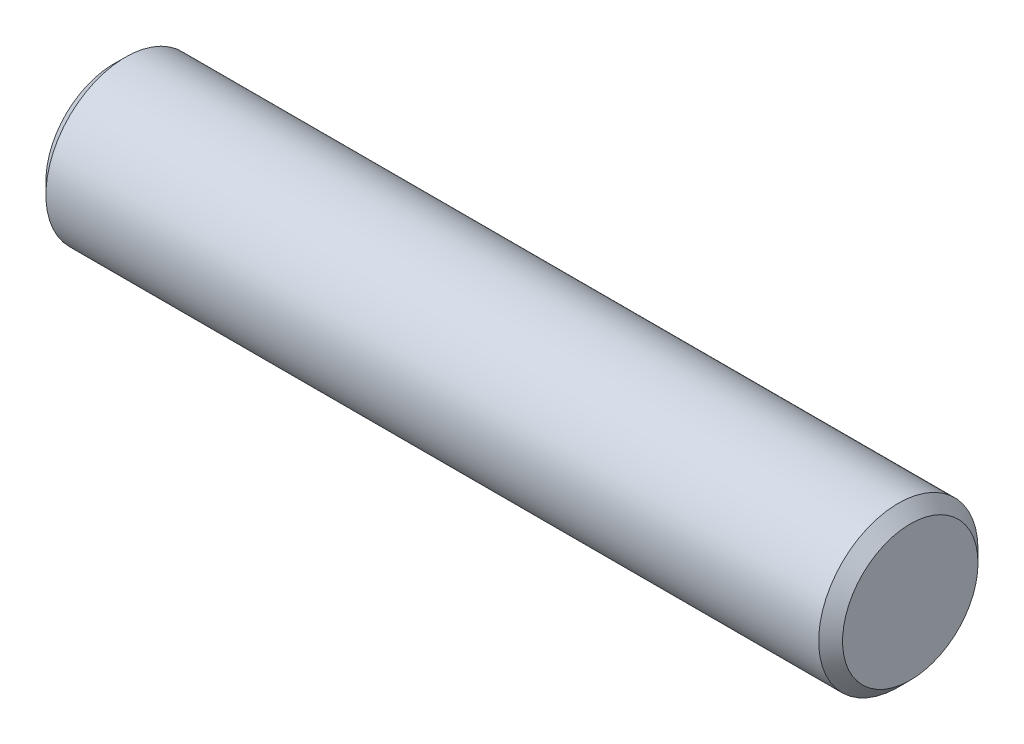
from build123d import *

# Parameters (mm, degrees)
BODYSKE_W     = 100
BODYSKE_H     = 10
CHAMFER1_SIZE = 1.5


with BuildPart() as part:
    # BodySke → BaseBody (revolve)
    with BuildSketch(Plane.XY, mode=Mode.PRIVATE) as basebody_sk:
        with Locations((50, 5)):
            Rectangle(BODYSKE_W, BODYSKE_H)
    revolve(basebody_sk.sketch.rotate(Axis((-3.175, 0, 0), (1, 0, 0)), 90), axis=Axis((-3.175, 0, 0), (1, 0, 0)))

    # Chamfer1
    chamfer1_edges = [part.edges().sort_by_distance(p)[0] for p in [
        (100, 0, -10),
        (0, 0, -10),
    ]]
    chamfer(chamfer1_edges, length=CHAMFER1_SIZE)


solid = part.part
